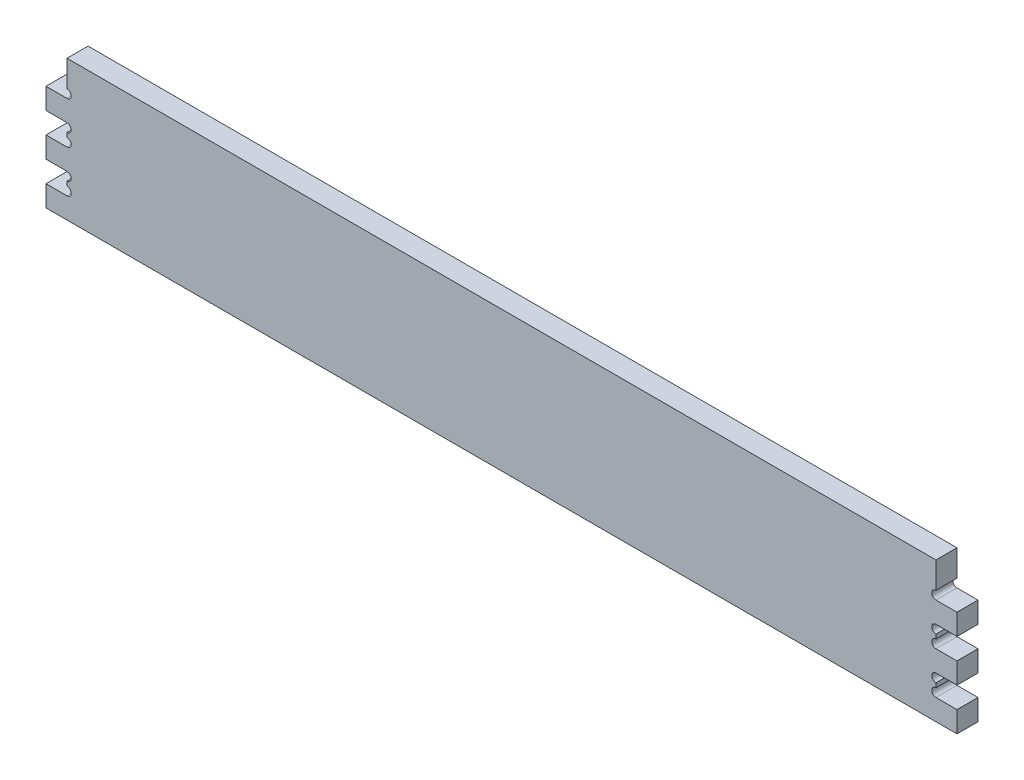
ISO-10303-21;
HEADER;
FILE_DESCRIPTION(('STEP AP214'),'2;1');
FILE_NAME('part.step','',(''),(''),'','','');
FILE_SCHEMA(('AUTOMOTIVE_DESIGN { 1 0 10303 214 1 1 1 1 }'));
ENDSEC;
DATA;
#1=APPLICATION_CONTEXT('core data for automotive mechanical design processes');
#2=APPLICATION_PROTOCOL_DEFINITION('international standard','automotive_design',2000,#1);
#3=PRODUCT_CONTEXT('',#1,'mechanical');
#4=PRODUCT('Part','Part','',(#3));
#5=PRODUCT_RELATED_PRODUCT_CATEGORY('part','',(#4));
#6=PRODUCT_DEFINITION_FORMATION('','',#4);
#7=PRODUCT_DEFINITION_CONTEXT('part definition',#1,'design');
#8=PRODUCT_DEFINITION('design','',#6,#7);
#9=PRODUCT_DEFINITION_SHAPE('','',#8);
#10=(LENGTH_UNIT() NAMED_UNIT(*) SI_UNIT(.MILLI.,.METRE.));
#11=(NAMED_UNIT(*) PLANE_ANGLE_UNIT() SI_UNIT($,.RADIAN.));
#12=(NAMED_UNIT(*) SI_UNIT($,.STERADIAN.) SOLID_ANGLE_UNIT());
#13=UNCERTAINTY_MEASURE_WITH_UNIT(LENGTH_MEASURE(1.E-05),#10,'distance_accuracy_value','');
#14=(GEOMETRIC_REPRESENTATION_CONTEXT(3) GLOBAL_UNCERTAINTY_ASSIGNED_CONTEXT((#13)) GLOBAL_UNIT_ASSIGNED_CONTEXT((#10,
#11,#12)) REPRESENTATION_CONTEXT('',''));
#15=CARTESIAN_POINT('',(0.,0.,0.));
#16=DIRECTION('',(0.,0.,1.));
#17=DIRECTION('',(1.,0.,0.));
#18=AXIS2_PLACEMENT_3D('',#15,#16,#17);
#19=CARTESIAN_POINT('',(620.,0.,15.));
#20=DIRECTION('',(0.,1.,0.));
#21=DIRECTION('',(-1.,0.,0.));
#22=AXIS2_PLACEMENT_3D('',#19,#20,#21);
#23=PLANE('',#22);
#24=DIRECTION('',(1.,0.,0.));
#25=VECTOR('',#24,1.);
#26=CARTESIAN_POINT('',(620.,0.,0.));
#27=LINE('',#26,#25);
#28=CARTESIAN_POINT('',(-15.,0.,0.));
#29=VERTEX_POINT('',#28);
#30=CARTESIAN_POINT('',(635.,0.,0.));
#31=VERTEX_POINT('',#30);
#32=EDGE_CURVE('E163',#29,#31,#27,.T.);
#33=ORIENTED_EDGE('',*,*,#32,.T.);
#34=DIRECTION('',(0.,0.,-1.));
#35=VECTOR('',#34,1.);
#36=CARTESIAN_POINT('',(635.,0.,15.));
#37=LINE('',#36,#35);
#38=CARTESIAN_POINT('',(635.,0.,15.));
#39=VERTEX_POINT('',#38);
#40=EDGE_CURVE('E11',#39,#31,#37,.T.);
#41=ORIENTED_EDGE('',*,*,#40,.F.);
#42=DIRECTION('',(1.,0.,0.));
#43=VECTOR('',#42,1.);
#44=CARTESIAN_POINT('',(0.,0.,15.));
#45=LINE('',#44,#43);
#46=CARTESIAN_POINT('',(-15.,0.,15.));
#47=VERTEX_POINT('',#46);
#48=EDGE_CURVE('E169',#47,#39,#45,.T.);
#49=ORIENTED_EDGE('',*,*,#48,.F.);
#50=DIRECTION('',(0.,0.,-1.));
#51=VECTOR('',#50,1.);
#52=CARTESIAN_POINT('',(-15.,0.,15.));
#53=LINE('',#52,#51);
#54=EDGE_CURVE('E281',#47,#29,#53,.T.);
#55=ORIENTED_EDGE('',*,*,#54,.T.);
#56=EDGE_LOOP('',(#33,#41,#49,#55));
#57=FACE_BOUND('',#56,.T.);
#58=ADVANCED_FACE('F33',(#57),#23,.F.);
#59=CARTESIAN_POINT('',(635.,0.,15.));
#60=DIRECTION('',(-1.,0.,0.));
#61=DIRECTION('',(0.,0.,1.));
#62=AXIS2_PLACEMENT_3D('',#59,#60,#61);
#63=PLANE('',#62);
#64=DIRECTION('',(0.,1.,0.));
#65=VECTOR('',#64,1.);
#66=CARTESIAN_POINT('',(635.,0.,0.));
#67=LINE('',#66,#65);
#68=CARTESIAN_POINT('',(635.,15.0000000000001,0.));
#69=VERTEX_POINT('',#68);
#70=EDGE_CURVE('E286',#31,#69,#67,.T.);
#71=ORIENTED_EDGE('',*,*,#70,.T.);
#72=DIRECTION('',(0.,0.,-1.));
#73=VECTOR('',#72,1.);
#74=CARTESIAN_POINT('',(635.,15.0000000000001,15.));
#75=LINE('',#74,#73);
#76=CARTESIAN_POINT('',(635.,15.0000000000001,15.));
#77=VERTEX_POINT('',#76);
#78=EDGE_CURVE('E41',#77,#69,#75,.T.);
#79=ORIENTED_EDGE('',*,*,#78,.F.);
#80=DIRECTION('',(0.,1.,0.));
#81=VECTOR('',#80,1.);
#82=CARTESIAN_POINT('',(635.,0.,15.));
#83=LINE('',#82,#81);
#84=EDGE_CURVE('E528',#39,#77,#83,.T.);
#85=ORIENTED_EDGE('',*,*,#84,.F.);
#86=ORIENTED_EDGE('',*,*,#40,.T.);
#87=EDGE_LOOP('',(#71,#79,#85,#86));
#88=FACE_BOUND('',#87,.T.);
#89=ADVANCED_FACE('F531',(#88),#63,.F.);
#90=CARTESIAN_POINT('',(635.,15.0000000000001,15.));
#91=DIRECTION('',(0.,-1.,0.));
#92=DIRECTION('',(1.,0.,0.));
#93=AXIS2_PLACEMENT_3D('',#90,#91,#92);
#94=PLANE('',#93);
#95=DIRECTION('',(-1.,0.,0.));
#96=VECTOR('',#95,1.);
#97=CARTESIAN_POINT('',(635.,15.0000000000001,0.));
#98=LINE('',#97,#96);
#99=CARTESIAN_POINT('',(620.,15.0000000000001,0.));
#100=VERTEX_POINT('',#99);
#101=EDGE_CURVE('E288',#69,#100,#98,.T.);
#102=ORIENTED_EDGE('',*,*,#101,.T.);
#103=DIRECTION('',(0.,0.,-1.));
#104=VECTOR('',#103,1.);
#105=CARTESIAN_POINT('',(620.,15.0000000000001,15.));
#106=LINE('',#105,#104);
#107=CARTESIAN_POINT('',(620.,15.0000000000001,15.));
#108=VERTEX_POINT('',#107);
#109=EDGE_CURVE('E435',#108,#100,#106,.T.);
#110=ORIENTED_EDGE('',*,*,#109,.F.);
#111=DIRECTION('',(-1.,0.,0.));
#112=VECTOR('',#111,1.);
#113=CARTESIAN_POINT('',(635.,15.0000000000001,15.));
#114=LINE('',#113,#112);
#115=EDGE_CURVE('E444',#77,#108,#114,.T.);
#116=ORIENTED_EDGE('',*,*,#115,.F.);
#117=ORIENTED_EDGE('',*,*,#78,.T.);
#118=EDGE_LOOP('',(#102,#110,#116,#117));
#119=FACE_BOUND('',#118,.T.);
#120=ADVANCED_FACE('F442',(#119),#94,.F.);
#121=CARTESIAN_POINT('',(620.,18.0000000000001,15.));
#122=DIRECTION('',(0.,0.,-1.));
#123=DIRECTION('',(-1.,0.,0.));
#124=AXIS2_PLACEMENT_3D('',#121,#122,#123);
#125=CYLINDRICAL_SURFACE('',#124,3.);
#126=CARTESIAN_POINT('',(620.,18.0000000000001,0.));
#127=DIRECTION('',(0.,0.,-1.));
#128=DIRECTION('',(1.,0.,0.));
#129=AXIS2_PLACEMENT_3D('',#126,#127,#128);
#130=CIRCLE('',#129,3.);
#131=CARTESIAN_POINT('',(620.,21.0000000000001,0.));
#132=VERTEX_POINT('',#131);
#133=EDGE_CURVE('E290',#100,#132,#130,.T.);
#134=ORIENTED_EDGE('',*,*,#133,.T.);
#135=DIRECTION('',(0.,0.,-1.));
#136=VECTOR('',#135,1.);
#137=CARTESIAN_POINT('',(620.,21.0000000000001,15.));
#138=LINE('',#137,#136);
#139=CARTESIAN_POINT('',(620.,21.0000000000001,15.));
#140=VERTEX_POINT('',#139);
#141=EDGE_CURVE('E432',#140,#132,#138,.T.);
#142=ORIENTED_EDGE('',*,*,#141,.F.);
#143=CARTESIAN_POINT('',(620.,18.0000000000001,15.));
#144=DIRECTION('',(0.,0.,-1.));
#145=DIRECTION('',(1.,0.,0.));
#146=AXIS2_PLACEMENT_3D('',#143,#144,#145);
#147=CIRCLE('',#146,3.);
#148=EDGE_CURVE('E462',#108,#140,#147,.T.);
#149=ORIENTED_EDGE('',*,*,#148,.F.);
#150=ORIENTED_EDGE('',*,*,#109,.T.);
#151=EDGE_LOOP('',(#134,#142,#149,#150));
#152=FACE_BOUND('',#151,.T.);
#153=ADVANCED_FACE('F453',(#152),#125,.F.);
#154=CARTESIAN_POINT('',(620.,24.1,15.));
#155=DIRECTION('',(-1.,0.,0.));
#156=DIRECTION('',(0.,0.,1.));
#157=AXIS2_PLACEMENT_3D('',#154,#155,#156);
#158=PLANE('',#157);
#159=DIRECTION('',(0.,1.,0.));
#160=VECTOR('',#159,1.);
#161=CARTESIAN_POINT('',(620.,24.1,0.));
#162=LINE('',#161,#160);
#163=CARTESIAN_POINT('',(620.,24.1,0.));
#164=VERTEX_POINT('',#163);
#165=EDGE_CURVE('E292',#132,#164,#162,.T.);
#166=ORIENTED_EDGE('',*,*,#165,.T.);
#167=DIRECTION('',(0.,0.,-1.));
#168=VECTOR('',#167,1.);
#169=CARTESIAN_POINT('',(620.,24.1,15.));
#170=LINE('',#169,#168);
#171=CARTESIAN_POINT('',(620.,24.1,15.));
#172=VERTEX_POINT('',#171);
#173=EDGE_CURVE('E429',#172,#164,#170,.T.);
#174=ORIENTED_EDGE('',*,*,#173,.F.);
#175=DIRECTION('',(0.,1.,0.));
#176=VECTOR('',#175,1.);
#177=CARTESIAN_POINT('',(620.,24.1,15.));
#178=LINE('',#177,#176);
#179=EDGE_CURVE('E459',#140,#172,#178,.T.);
#180=ORIENTED_EDGE('',*,*,#179,.F.);
#181=ORIENTED_EDGE('',*,*,#141,.T.);
#182=EDGE_LOOP('',(#166,#174,#180,#181));
#183=FACE_BOUND('',#182,.T.);
#184=ADVANCED_FACE('F457',(#183),#158,.F.);
#185=CARTESIAN_POINT('',(620.,27.1,15.));
#186=DIRECTION('',(0.,0.,-1.));
#187=DIRECTION('',(-1.,0.,0.));
#188=AXIS2_PLACEMENT_3D('',#185,#186,#187);
#189=CYLINDRICAL_SURFACE('',#188,3.);
#190=CARTESIAN_POINT('',(620.,27.1,0.));
#191=DIRECTION('',(0.,0.,-1.));
#192=DIRECTION('',(1.,0.,0.));
#193=AXIS2_PLACEMENT_3D('',#190,#191,#192);
#194=CIRCLE('',#193,3.);
#195=CARTESIAN_POINT('',(620.,30.1,0.));
#196=VERTEX_POINT('',#195);
#197=EDGE_CURVE('E294',#164,#196,#194,.T.);
#198=ORIENTED_EDGE('',*,*,#197,.T.);
#199=DIRECTION('',(0.,0.,-1.));
#200=VECTOR('',#199,1.);
#201=CARTESIAN_POINT('',(620.,30.1,15.));
#202=LINE('',#201,#200);
#203=CARTESIAN_POINT('',(620.,30.1,15.));
#204=VERTEX_POINT('',#203);
#205=EDGE_CURVE('E426',#204,#196,#202,.T.);
#206=ORIENTED_EDGE('',*,*,#205,.F.);
#207=CARTESIAN_POINT('',(620.,27.1,15.));
#208=DIRECTION('',(0.,0.,-1.));
#209=DIRECTION('',(1.,0.,0.));
#210=AXIS2_PLACEMENT_3D('',#207,#208,#209);
#211=CIRCLE('',#210,3.);
#212=EDGE_CURVE('E461',#172,#204,#211,.T.);
#213=ORIENTED_EDGE('',*,*,#212,.F.);
#214=ORIENTED_EDGE('',*,*,#173,.T.);
#215=EDGE_LOOP('',(#198,#206,#213,#214));
#216=FACE_BOUND('',#215,.T.);
#217=ADVANCED_FACE('F543',(#216),#189,.F.);
#218=CARTESIAN_POINT('',(620.,30.1,15.));
#219=DIRECTION('',(0.,1.,0.));
#220=DIRECTION('',(-1.,0.,0.));
#221=AXIS2_PLACEMENT_3D('',#218,#219,#220);
#222=PLANE('',#221);
#223=DIRECTION('',(1.,0.,0.));
#224=VECTOR('',#223,1.);
#225=CARTESIAN_POINT('',(620.,30.1,0.));
#226=LINE('',#225,#224);
#227=CARTESIAN_POINT('',(635.,30.1,0.));
#228=VERTEX_POINT('',#227);
#229=EDGE_CURVE('E296',#196,#228,#226,.T.);
#230=ORIENTED_EDGE('',*,*,#229,.T.);
#231=DIRECTION('',(0.,0.,-1.));
#232=VECTOR('',#231,1.);
#233=CARTESIAN_POINT('',(635.,30.1,15.));
#234=LINE('',#233,#232);
#235=CARTESIAN_POINT('',(635.,30.1,15.));
#236=VERTEX_POINT('',#235);
#237=EDGE_CURVE('E423',#236,#228,#234,.T.);
#238=ORIENTED_EDGE('',*,*,#237,.F.);
#239=DIRECTION('',(1.,0.,0.));
#240=VECTOR('',#239,1.);
#241=CARTESIAN_POINT('',(620.,30.1,15.));
#242=LINE('',#241,#240);
#243=EDGE_CURVE('E464',#204,#236,#242,.T.);
#244=ORIENTED_EDGE('',*,*,#243,.F.);
#245=ORIENTED_EDGE('',*,*,#205,.T.);
#246=EDGE_LOOP('',(#230,#238,#244,#245));
#247=FACE_BOUND('',#246,.T.);
#248=ADVANCED_FACE('F546',(#247),#222,.F.);
#249=CARTESIAN_POINT('',(635.,30.1,15.));
#250=DIRECTION('',(-1.,0.,0.));
#251=DIRECTION('',(0.,0.,1.));
#252=AXIS2_PLACEMENT_3D('',#249,#250,#251);
#253=PLANE('',#252);
#254=DIRECTION('',(0.,1.,0.));
#255=VECTOR('',#254,1.);
#256=CARTESIAN_POINT('',(635.,30.1,0.));
#257=LINE('',#256,#255);
#258=CARTESIAN_POINT('',(635.,45.1,0.));
#259=VERTEX_POINT('',#258);
#260=EDGE_CURVE('E298',#228,#259,#257,.T.);
#261=ORIENTED_EDGE('',*,*,#260,.T.);
#262=DIRECTION('',(0.,0.,-1.));
#263=VECTOR('',#262,1.);
#264=CARTESIAN_POINT('',(635.,45.1,15.));
#265=LINE('',#264,#263);
#266=CARTESIAN_POINT('',(635.,45.1,15.));
#267=VERTEX_POINT('',#266);
#268=EDGE_CURVE('E420',#267,#259,#265,.T.);
#269=ORIENTED_EDGE('',*,*,#268,.F.);
#270=DIRECTION('',(0.,1.,0.));
#271=VECTOR('',#270,1.);
#272=CARTESIAN_POINT('',(635.,30.1,15.));
#273=LINE('',#272,#271);
#274=EDGE_CURVE('E470',#236,#267,#273,.T.);
#275=ORIENTED_EDGE('',*,*,#274,.F.);
#276=ORIENTED_EDGE('',*,*,#237,.T.);
#277=EDGE_LOOP('',(#261,#269,#275,#276));
#278=FACE_BOUND('',#277,.T.);
#279=ADVANCED_FACE('F550',(#278),#253,.F.);
#280=CARTESIAN_POINT('',(635.,45.1,15.));
#281=DIRECTION('',(0.,-1.,0.));
#282=DIRECTION('',(0.,0.,-1.));
#283=AXIS2_PLACEMENT_3D('',#280,#281,#282);
#284=PLANE('',#283);
#285=DIRECTION('',(-1.,0.,0.));
#286=VECTOR('',#285,1.);
#287=CARTESIAN_POINT('',(635.,45.1,0.));
#288=LINE('',#287,#286);
#289=CARTESIAN_POINT('',(620.,45.1,0.));
#290=VERTEX_POINT('',#289);
#291=EDGE_CURVE('E300',#259,#290,#288,.T.);
#292=ORIENTED_EDGE('',*,*,#291,.T.);
#293=DIRECTION('',(0.,0.,-1.));
#294=VECTOR('',#293,1.);
#295=CARTESIAN_POINT('',(620.,45.1,15.));
#296=LINE('',#295,#294);
#297=CARTESIAN_POINT('',(620.,45.1,15.));
#298=VERTEX_POINT('',#297);
#299=EDGE_CURVE('E417',#298,#290,#296,.T.);
#300=ORIENTED_EDGE('',*,*,#299,.F.);
#301=DIRECTION('',(-1.,0.,0.));
#302=VECTOR('',#301,1.);
#303=CARTESIAN_POINT('',(635.,45.1,15.));
#304=LINE('',#303,#302);
#305=EDGE_CURVE('E472',#267,#298,#304,.T.);
#306=ORIENTED_EDGE('',*,*,#305,.F.);
#307=ORIENTED_EDGE('',*,*,#268,.T.);
#308=EDGE_LOOP('',(#292,#300,#306,#307));
#309=FACE_BOUND('',#308,.T.);
#310=ADVANCED_FACE('F554',(#309),#284,.F.);
#311=CARTESIAN_POINT('',(620.,48.1,15.));
#312=DIRECTION('',(0.,0.,-1.));
#313=DIRECTION('',(-1.,0.,0.));
#314=AXIS2_PLACEMENT_3D('',#311,#312,#313);
#315=CYLINDRICAL_SURFACE('',#314,3.);
#316=CARTESIAN_POINT('',(620.,48.1,0.));
#317=DIRECTION('',(0.,0.,-1.));
#318=DIRECTION('',(1.,0.,0.));
#319=AXIS2_PLACEMENT_3D('',#316,#317,#318);
#320=CIRCLE('',#319,3.);
#321=CARTESIAN_POINT('',(620.,51.1,0.));
#322=VERTEX_POINT('',#321);
#323=EDGE_CURVE('E302',#290,#322,#320,.T.);
#324=ORIENTED_EDGE('',*,*,#323,.T.);
#325=DIRECTION('',(0.,0.,-1.));
#326=VECTOR('',#325,1.);
#327=CARTESIAN_POINT('',(620.,51.1,15.));
#328=LINE('',#327,#326);
#329=CARTESIAN_POINT('',(620.,51.1,15.));
#330=VERTEX_POINT('',#329);
#331=EDGE_CURVE('E414',#330,#322,#328,.T.);
#332=ORIENTED_EDGE('',*,*,#331,.F.);
#333=CARTESIAN_POINT('',(620.,48.1,15.));
#334=DIRECTION('',(0.,0.,-1.));
#335=DIRECTION('',(1.,0.,0.));
#336=AXIS2_PLACEMENT_3D('',#333,#334,#335);
#337=CIRCLE('',#336,3.);
#338=EDGE_CURVE('E474',#298,#330,#337,.T.);
#339=ORIENTED_EDGE('',*,*,#338,.F.);
#340=ORIENTED_EDGE('',*,*,#299,.T.);
#341=EDGE_LOOP('',(#324,#332,#339,#340));
#342=FACE_BOUND('',#341,.T.);
#343=ADVANCED_FACE('F558',(#342),#315,.F.);
#344=CARTESIAN_POINT('',(620.,54.2,15.));
#345=DIRECTION('',(-1.,0.,0.));
#346=DIRECTION('',(0.,0.,1.));
#347=AXIS2_PLACEMENT_3D('',#344,#345,#346);
#348=PLANE('',#347);
#349=DIRECTION('',(0.,1.,0.));
#350=VECTOR('',#349,1.);
#351=CARTESIAN_POINT('',(620.,54.2,0.));
#352=LINE('',#351,#350);
#353=CARTESIAN_POINT('',(620.,54.2,0.));
#354=VERTEX_POINT('',#353);
#355=EDGE_CURVE('E304',#322,#354,#352,.T.);
#356=ORIENTED_EDGE('',*,*,#355,.T.);
#357=DIRECTION('',(0.,0.,-1.));
#358=VECTOR('',#357,1.);
#359=CARTESIAN_POINT('',(620.,54.2,15.));
#360=LINE('',#359,#358);
#361=CARTESIAN_POINT('',(620.,54.2,15.));
#362=VERTEX_POINT('',#361);
#363=EDGE_CURVE('E411',#362,#354,#360,.T.);
#364=ORIENTED_EDGE('',*,*,#363,.F.);
#365=DIRECTION('',(0.,1.,0.));
#366=VECTOR('',#365,1.);
#367=CARTESIAN_POINT('',(620.,54.2,15.));
#368=LINE('',#367,#366);
#369=EDGE_CURVE('E476',#330,#362,#368,.T.);
#370=ORIENTED_EDGE('',*,*,#369,.F.);
#371=ORIENTED_EDGE('',*,*,#331,.T.);
#372=EDGE_LOOP('',(#356,#364,#370,#371));
#373=FACE_BOUND('',#372,.T.);
#374=ADVANCED_FACE('F562',(#373),#348,.F.);
#375=CARTESIAN_POINT('',(620.,57.2,15.));
#376=DIRECTION('',(0.,0.,-1.));
#377=DIRECTION('',(-1.,0.,0.));
#378=AXIS2_PLACEMENT_3D('',#375,#376,#377);
#379=CYLINDRICAL_SURFACE('',#378,3.);
#380=CARTESIAN_POINT('',(620.,57.2,0.));
#381=DIRECTION('',(0.,0.,-1.));
#382=DIRECTION('',(1.,0.,0.));
#383=AXIS2_PLACEMENT_3D('',#380,#381,#382);
#384=CIRCLE('',#383,3.);
#385=CARTESIAN_POINT('',(620.,60.2,0.));
#386=VERTEX_POINT('',#385);
#387=EDGE_CURVE('E306',#354,#386,#384,.T.);
#388=ORIENTED_EDGE('',*,*,#387,.T.);
#389=DIRECTION('',(0.,0.,-1.));
#390=VECTOR('',#389,1.);
#391=CARTESIAN_POINT('',(620.,60.2,15.));
#392=LINE('',#391,#390);
#393=CARTESIAN_POINT('',(620.,60.2,15.));
#394=VERTEX_POINT('',#393);
#395=EDGE_CURVE('E408',#394,#386,#392,.T.);
#396=ORIENTED_EDGE('',*,*,#395,.F.);
#397=CARTESIAN_POINT('',(620.,57.2,15.));
#398=DIRECTION('',(0.,0.,-1.));
#399=DIRECTION('',(1.,0.,0.));
#400=AXIS2_PLACEMENT_3D('',#397,#398,#399);
#401=CIRCLE('',#400,3.);
#402=EDGE_CURVE('E478',#362,#394,#401,.T.);
#403=ORIENTED_EDGE('',*,*,#402,.F.);
#404=ORIENTED_EDGE('',*,*,#363,.T.);
#405=EDGE_LOOP('',(#388,#396,#403,#404));
#406=FACE_BOUND('',#405,.T.);
#407=ADVANCED_FACE('F566',(#406),#379,.F.);
#408=CARTESIAN_POINT('',(620.,60.2,15.));
#409=DIRECTION('',(0.,1.,0.));
#410=DIRECTION('',(-1.,0.,0.));
#411=AXIS2_PLACEMENT_3D('',#408,#409,#410);
#412=PLANE('',#411);
#413=DIRECTION('',(1.,0.,0.));
#414=VECTOR('',#413,1.);
#415=CARTESIAN_POINT('',(620.,60.2,0.));
#416=LINE('',#415,#414);
#417=CARTESIAN_POINT('',(635.,60.2,0.));
#418=VERTEX_POINT('',#417);
#419=EDGE_CURVE('E308',#386,#418,#416,.T.);
#420=ORIENTED_EDGE('',*,*,#419,.T.);
#421=DIRECTION('',(0.,0.,-1.));
#422=VECTOR('',#421,1.);
#423=CARTESIAN_POINT('',(635.,60.2,15.));
#424=LINE('',#423,#422);
#425=CARTESIAN_POINT('',(635.,60.2,15.));
#426=VERTEX_POINT('',#425);
#427=EDGE_CURVE('E405',#426,#418,#424,.T.);
#428=ORIENTED_EDGE('',*,*,#427,.F.);
#429=DIRECTION('',(1.,0.,0.));
#430=VECTOR('',#429,1.);
#431=CARTESIAN_POINT('',(620.,60.2,15.));
#432=LINE('',#431,#430);
#433=EDGE_CURVE('E480',#394,#426,#432,.T.);
#434=ORIENTED_EDGE('',*,*,#433,.F.);
#435=ORIENTED_EDGE('',*,*,#395,.T.);
#436=EDGE_LOOP('',(#420,#428,#434,#435));
#437=FACE_BOUND('',#436,.T.);
#438=ADVANCED_FACE('F570',(#437),#412,.F.);
#439=CARTESIAN_POINT('',(635.,60.2,15.));
#440=DIRECTION('',(-1.,0.,0.));
#441=DIRECTION('',(0.,0.,1.));
#442=AXIS2_PLACEMENT_3D('',#439,#440,#441);
#443=PLANE('',#442);
#444=DIRECTION('',(0.,1.,0.));
#445=VECTOR('',#444,1.);
#446=CARTESIAN_POINT('',(635.,60.2,0.));
#447=LINE('',#446,#445);
#448=CARTESIAN_POINT('',(635.,75.2,0.));
#449=VERTEX_POINT('',#448);
#450=EDGE_CURVE('E310',#418,#449,#447,.T.);
#451=ORIENTED_EDGE('',*,*,#450,.T.);
#452=DIRECTION('',(0.,0.,-1.));
#453=VECTOR('',#452,1.);
#454=CARTESIAN_POINT('',(635.,75.2,15.));
#455=LINE('',#454,#453);
#456=CARTESIAN_POINT('',(635.,75.2,15.));
#457=VERTEX_POINT('',#456);
#458=EDGE_CURVE('E402',#457,#449,#455,.T.);
#459=ORIENTED_EDGE('',*,*,#458,.F.);
#460=DIRECTION('',(0.,1.,0.));
#461=VECTOR('',#460,1.);
#462=CARTESIAN_POINT('',(635.,60.2,15.));
#463=LINE('',#462,#461);
#464=EDGE_CURVE('E482',#426,#457,#463,.T.);
#465=ORIENTED_EDGE('',*,*,#464,.F.);
#466=ORIENTED_EDGE('',*,*,#427,.T.);
#467=EDGE_LOOP('',(#451,#459,#465,#466));
#468=FACE_BOUND('',#467,.T.);
#469=ADVANCED_FACE('F574',(#468),#443,.F.);
#470=CARTESIAN_POINT('',(635.,75.2,15.));
#471=DIRECTION('',(0.,-1.,0.));
#472=DIRECTION('',(0.,0.,-1.));
#473=AXIS2_PLACEMENT_3D('',#470,#471,#472);
#474=PLANE('',#473);
#475=DIRECTION('',(-1.,0.,0.));
#476=VECTOR('',#475,1.);
#477=CARTESIAN_POINT('',(635.,75.2,0.));
#478=LINE('',#477,#476);
#479=CARTESIAN_POINT('',(620.,75.2,0.));
#480=VERTEX_POINT('',#479);
#481=EDGE_CURVE('E312',#449,#480,#478,.T.);
#482=ORIENTED_EDGE('',*,*,#481,.T.);
#483=DIRECTION('',(0.,0.,-1.));
#484=VECTOR('',#483,1.);
#485=CARTESIAN_POINT('',(620.,75.2,15.));
#486=LINE('',#485,#484);
#487=CARTESIAN_POINT('',(620.,75.2,15.));
#488=VERTEX_POINT('',#487);
#489=EDGE_CURVE('E399',#488,#480,#486,.T.);
#490=ORIENTED_EDGE('',*,*,#489,.F.);
#491=DIRECTION('',(-1.,0.,0.));
#492=VECTOR('',#491,1.);
#493=CARTESIAN_POINT('',(635.,75.2,15.));
#494=LINE('',#493,#492);
#495=EDGE_CURVE('E484',#457,#488,#494,.T.);
#496=ORIENTED_EDGE('',*,*,#495,.F.);
#497=ORIENTED_EDGE('',*,*,#458,.T.);
#498=EDGE_LOOP('',(#482,#490,#496,#497));
#499=FACE_BOUND('',#498,.T.);
#500=ADVANCED_FACE('F578',(#499),#474,.F.);
#501=CARTESIAN_POINT('',(620.,78.2,15.));
#502=DIRECTION('',(0.,0.,-1.));
#503=DIRECTION('',(-1.,0.,0.));
#504=AXIS2_PLACEMENT_3D('',#501,#502,#503);
#505=CYLINDRICAL_SURFACE('',#504,3.);
#506=CARTESIAN_POINT('',(620.,78.2,0.));
#507=DIRECTION('',(0.,0.,-1.));
#508=DIRECTION('',(1.,0.,0.));
#509=AXIS2_PLACEMENT_3D('',#506,#507,#508);
#510=CIRCLE('',#509,3.);
#511=CARTESIAN_POINT('',(620.,81.2,0.));
#512=VERTEX_POINT('',#511);
#513=EDGE_CURVE('E314',#480,#512,#510,.T.);
#514=ORIENTED_EDGE('',*,*,#513,.T.);
#515=DIRECTION('',(0.,0.,-1.));
#516=VECTOR('',#515,1.);
#517=CARTESIAN_POINT('',(620.,81.2,15.));
#518=LINE('',#517,#516);
#519=CARTESIAN_POINT('',(620.,81.2,15.));
#520=VERTEX_POINT('',#519);
#521=EDGE_CURVE('E396',#520,#512,#518,.T.);
#522=ORIENTED_EDGE('',*,*,#521,.F.);
#523=CARTESIAN_POINT('',(620.,78.2,15.));
#524=DIRECTION('',(0.,0.,-1.));
#525=DIRECTION('',(1.,0.,0.));
#526=AXIS2_PLACEMENT_3D('',#523,#524,#525);
#527=CIRCLE('',#526,3.);
#528=EDGE_CURVE('E486',#488,#520,#527,.T.);
#529=ORIENTED_EDGE('',*,*,#528,.F.);
#530=ORIENTED_EDGE('',*,*,#489,.T.);
#531=EDGE_LOOP('',(#514,#522,#529,#530));
#532=FACE_BOUND('',#531,.T.);
#533=ADVANCED_FACE('F582',(#532),#505,.F.);
#534=CARTESIAN_POINT('',(620.,100.,15.));
#535=DIRECTION('',(-1.,0.,0.));
#536=DIRECTION('',(0.,0.,1.));
#537=AXIS2_PLACEMENT_3D('',#534,#535,#536);
#538=PLANE('',#537);
#539=DIRECTION('',(0.,1.,0.));
#540=VECTOR('',#539,1.);
#541=CARTESIAN_POINT('',(620.,100.,0.));
#542=LINE('',#541,#540);
#543=CARTESIAN_POINT('',(620.,100.,0.));
#544=VERTEX_POINT('',#543);
#545=EDGE_CURVE('E316',#512,#544,#542,.T.);
#546=ORIENTED_EDGE('',*,*,#545,.T.);
#547=DIRECTION('',(0.,0.,-1.));
#548=VECTOR('',#547,1.);
#549=CARTESIAN_POINT('',(620.,100.,15.));
#550=LINE('',#549,#548);
#551=CARTESIAN_POINT('',(620.,100.,15.));
#552=VERTEX_POINT('',#551);
#553=EDGE_CURVE('E393',#552,#544,#550,.T.);
#554=ORIENTED_EDGE('',*,*,#553,.F.);
#555=DIRECTION('',(0.,1.,0.));
#556=VECTOR('',#555,1.);
#557=CARTESIAN_POINT('',(620.,100.,15.));
#558=LINE('',#557,#556);
#559=EDGE_CURVE('E488',#520,#552,#558,.T.);
#560=ORIENTED_EDGE('',*,*,#559,.F.);
#561=ORIENTED_EDGE('',*,*,#521,.T.);
#562=EDGE_LOOP('',(#546,#554,#560,#561));
#563=FACE_BOUND('',#562,.T.);
#564=ADVANCED_FACE('F586',(#563),#538,.F.);
#565=CARTESIAN_POINT('',(0.,100.,15.));
#566=DIRECTION('',(0.,-1.,0.));
#567=DIRECTION('',(1.,0.,0.));
#568=AXIS2_PLACEMENT_3D('',#565,#566,#567);
#569=PLANE('',#568);
#570=DIRECTION('',(-1.,0.,0.));
#571=VECTOR('',#570,1.);
#572=CARTESIAN_POINT('',(0.,100.,0.));
#573=LINE('',#572,#571);
#574=CARTESIAN_POINT('',(0.,100.,0.));
#575=VERTEX_POINT('',#574);
#576=EDGE_CURVE('E318',#544,#575,#573,.T.);
#577=ORIENTED_EDGE('',*,*,#576,.T.);
#578=DIRECTION('',(0.,0.,-1.));
#579=VECTOR('',#578,1.);
#580=CARTESIAN_POINT('',(0.,100.,15.));
#581=LINE('',#580,#579);
#582=CARTESIAN_POINT('',(0.,100.,15.));
#583=VERTEX_POINT('',#582);
#584=EDGE_CURVE('E390',#583,#575,#581,.T.);
#585=ORIENTED_EDGE('',*,*,#584,.F.);
#586=DIRECTION('',(-1.,0.,0.));
#587=VECTOR('',#586,1.);
#588=CARTESIAN_POINT('',(0.,100.,15.));
#589=LINE('',#588,#587);
#590=EDGE_CURVE('E490',#552,#583,#589,.T.);
#591=ORIENTED_EDGE('',*,*,#590,.F.);
#592=ORIENTED_EDGE('',*,*,#553,.T.);
#593=EDGE_LOOP('',(#577,#585,#591,#592));
#594=FACE_BOUND('',#593,.T.);
#595=ADVANCED_FACE('F590',(#594),#569,.F.);
#596=CARTESIAN_POINT('',(0.,100.,15.));
#597=DIRECTION('',(1.,0.,0.));
#598=DIRECTION('',(0.,1.,0.));
#599=AXIS2_PLACEMENT_3D('',#596,#597,#598);
#600=PLANE('',#599);
#601=DIRECTION('',(0.,-1.,0.));
#602=VECTOR('',#601,1.);
#603=CARTESIAN_POINT('',(0.,100.,0.));
#604=LINE('',#603,#602);
#605=CARTESIAN_POINT('',(0.,81.2,0.));
#606=VERTEX_POINT('',#605);
#607=EDGE_CURVE('E320',#575,#606,#604,.T.);
#608=ORIENTED_EDGE('',*,*,#607,.T.);
#609=DIRECTION('',(0.,0.,-1.));
#610=VECTOR('',#609,1.);
#611=CARTESIAN_POINT('',(0.,81.2,15.));
#612=LINE('',#611,#610);
#613=CARTESIAN_POINT('',(0.,81.2,15.));
#614=VERTEX_POINT('',#613);
#615=EDGE_CURVE('E387',#614,#606,#612,.T.);
#616=ORIENTED_EDGE('',*,*,#615,.F.);
#617=DIRECTION('',(0.,-1.,0.));
#618=VECTOR('',#617,1.);
#619=CARTESIAN_POINT('',(0.,100.,15.));
#620=LINE('',#619,#618);
#621=EDGE_CURVE('E492',#583,#614,#620,.T.);
#622=ORIENTED_EDGE('',*,*,#621,.F.);
#623=ORIENTED_EDGE('',*,*,#584,.T.);
#624=EDGE_LOOP('',(#608,#616,#622,#623));
#625=FACE_BOUND('',#624,.T.);
#626=ADVANCED_FACE('F594',(#625),#600,.F.);
#627=CARTESIAN_POINT('',(0.,78.2,15.));
#628=DIRECTION('',(0.,0.,-1.));
#629=DIRECTION('',(-1.,0.,0.));
#630=AXIS2_PLACEMENT_3D('',#627,#628,#629);
#631=CYLINDRICAL_SURFACE('',#630,3.);
#632=CARTESIAN_POINT('',(0.,78.2,0.));
#633=DIRECTION('',(0.,0.,-1.));
#634=DIRECTION('',(1.,0.,0.));
#635=AXIS2_PLACEMENT_3D('',#632,#633,#634);
#636=CIRCLE('',#635,3.);
#637=CARTESIAN_POINT('',(0.,75.2,0.));
#638=VERTEX_POINT('',#637);
#639=EDGE_CURVE('E322',#606,#638,#636,.T.);
#640=ORIENTED_EDGE('',*,*,#639,.T.);
#641=DIRECTION('',(0.,0.,-1.));
#642=VECTOR('',#641,1.);
#643=CARTESIAN_POINT('',(0.,75.2,15.));
#644=LINE('',#643,#642);
#645=CARTESIAN_POINT('',(0.,75.2,15.));
#646=VERTEX_POINT('',#645);
#647=EDGE_CURVE('E384',#646,#638,#644,.T.);
#648=ORIENTED_EDGE('',*,*,#647,.F.);
#649=CARTESIAN_POINT('',(0.,78.2,15.));
#650=DIRECTION('',(0.,0.,-1.));
#651=DIRECTION('',(1.,0.,0.));
#652=AXIS2_PLACEMENT_3D('',#649,#650,#651);
#653=CIRCLE('',#652,3.);
#654=EDGE_CURVE('E494',#614,#646,#653,.T.);
#655=ORIENTED_EDGE('',*,*,#654,.F.);
#656=ORIENTED_EDGE('',*,*,#615,.T.);
#657=EDGE_LOOP('',(#640,#648,#655,#656));
#658=FACE_BOUND('',#657,.T.);
#659=ADVANCED_FACE('F598',(#658),#631,.F.);
#660=CARTESIAN_POINT('',(-15.,75.2,15.));
#661=DIRECTION('',(0.,-1.,0.));
#662=DIRECTION('',(0.,0.,-1.));
#663=AXIS2_PLACEMENT_3D('',#660,#661,#662);
#664=PLANE('',#663);
#665=DIRECTION('',(-1.,0.,0.));
#666=VECTOR('',#665,1.);
#667=CARTESIAN_POINT('',(-15.,75.2,0.));
#668=LINE('',#667,#666);
#669=CARTESIAN_POINT('',(-15.,75.2,0.));
#670=VERTEX_POINT('',#669);
#671=EDGE_CURVE('E324',#638,#670,#668,.T.);
#672=ORIENTED_EDGE('',*,*,#671,.T.);
#673=DIRECTION('',(0.,0.,-1.));
#674=VECTOR('',#673,1.);
#675=CARTESIAN_POINT('',(-15.,75.2,15.));
#676=LINE('',#675,#674);
#677=CARTESIAN_POINT('',(-15.,75.2,15.));
#678=VERTEX_POINT('',#677);
#679=EDGE_CURVE('E381',#678,#670,#676,.T.);
#680=ORIENTED_EDGE('',*,*,#679,.F.);
#681=DIRECTION('',(-1.,0.,0.));
#682=VECTOR('',#681,1.);
#683=CARTESIAN_POINT('',(-15.,75.2,15.));
#684=LINE('',#683,#682);
#685=EDGE_CURVE('E496',#646,#678,#684,.T.);
#686=ORIENTED_EDGE('',*,*,#685,.F.);
#687=ORIENTED_EDGE('',*,*,#647,.T.);
#688=EDGE_LOOP('',(#672,#680,#686,#687));
#689=FACE_BOUND('',#688,.T.);
#690=ADVANCED_FACE('F602',(#689),#664,.F.);
#691=CARTESIAN_POINT('',(-15.,60.2,15.));
#692=DIRECTION('',(1.,0.,0.));
#693=DIRECTION('',(0.,0.,-1.));
#694=AXIS2_PLACEMENT_3D('',#691,#692,#693);
#695=PLANE('',#694);
#696=DIRECTION('',(0.,-1.,0.));
#697=VECTOR('',#696,1.);
#698=CARTESIAN_POINT('',(-15.,60.2,0.));
#699=LINE('',#698,#697);
#700=CARTESIAN_POINT('',(-15.,60.2,0.));
#701=VERTEX_POINT('',#700);
#702=EDGE_CURVE('E326',#670,#701,#699,.T.);
#703=ORIENTED_EDGE('',*,*,#702,.T.);
#704=DIRECTION('',(0.,0.,-1.));
#705=VECTOR('',#704,1.);
#706=CARTESIAN_POINT('',(-15.,60.2,15.));
#707=LINE('',#706,#705);
#708=CARTESIAN_POINT('',(-15.,60.2,15.));
#709=VERTEX_POINT('',#708);
#710=EDGE_CURVE('E378',#709,#701,#707,.T.);
#711=ORIENTED_EDGE('',*,*,#710,.F.);
#712=DIRECTION('',(0.,-1.,0.));
#713=VECTOR('',#712,1.);
#714=CARTESIAN_POINT('',(-15.,60.2,15.));
#715=LINE('',#714,#713);
#716=EDGE_CURVE('E498',#678,#709,#715,.T.);
#717=ORIENTED_EDGE('',*,*,#716,.F.);
#718=ORIENTED_EDGE('',*,*,#679,.T.);
#719=EDGE_LOOP('',(#703,#711,#717,#718));
#720=FACE_BOUND('',#719,.T.);
#721=ADVANCED_FACE('F606',(#720),#695,.F.);
#722=CARTESIAN_POINT('',(0.,60.2,15.));
#723=DIRECTION('',(0.,1.,0.));
#724=DIRECTION('',(0.,0.,1.));
#725=AXIS2_PLACEMENT_3D('',#722,#723,#724);
#726=PLANE('',#725);
#727=DIRECTION('',(1.,0.,0.));
#728=VECTOR('',#727,1.);
#729=CARTESIAN_POINT('',(0.,60.2,0.));
#730=LINE('',#729,#728);
#731=CARTESIAN_POINT('',(0.,60.2,0.));
#732=VERTEX_POINT('',#731);
#733=EDGE_CURVE('E328',#701,#732,#730,.T.);
#734=ORIENTED_EDGE('',*,*,#733,.T.);
#735=DIRECTION('',(0.,0.,-1.));
#736=VECTOR('',#735,1.);
#737=CARTESIAN_POINT('',(0.,60.2,15.));
#738=LINE('',#737,#736);
#739=CARTESIAN_POINT('',(0.,60.2,15.));
#740=VERTEX_POINT('',#739);
#741=EDGE_CURVE('E375',#740,#732,#738,.T.);
#742=ORIENTED_EDGE('',*,*,#741,.F.);
#743=DIRECTION('',(1.,0.,0.));
#744=VECTOR('',#743,1.);
#745=CARTESIAN_POINT('',(0.,60.2,15.));
#746=LINE('',#745,#744);
#747=EDGE_CURVE('E500',#709,#740,#746,.T.);
#748=ORIENTED_EDGE('',*,*,#747,.F.);
#749=ORIENTED_EDGE('',*,*,#710,.T.);
#750=EDGE_LOOP('',(#734,#742,#748,#749));
#751=FACE_BOUND('',#750,.T.);
#752=ADVANCED_FACE('F610',(#751),#726,.F.);
#753=CARTESIAN_POINT('',(0.,57.2,15.));
#754=DIRECTION('',(0.,0.,-1.));
#755=DIRECTION('',(-1.,0.,0.));
#756=AXIS2_PLACEMENT_3D('',#753,#754,#755);
#757=CYLINDRICAL_SURFACE('',#756,3.);
#758=CARTESIAN_POINT('',(0.,57.2,0.));
#759=DIRECTION('',(0.,0.,-1.));
#760=DIRECTION('',(1.,0.,0.));
#761=AXIS2_PLACEMENT_3D('',#758,#759,#760);
#762=CIRCLE('',#761,3.);
#763=CARTESIAN_POINT('',(0.,54.2,0.));
#764=VERTEX_POINT('',#763);
#765=EDGE_CURVE('E330',#732,#764,#762,.T.);
#766=ORIENTED_EDGE('',*,*,#765,.T.);
#767=DIRECTION('',(0.,0.,-1.));
#768=VECTOR('',#767,1.);
#769=CARTESIAN_POINT('',(0.,54.2,15.));
#770=LINE('',#769,#768);
#771=CARTESIAN_POINT('',(0.,54.2,15.));
#772=VERTEX_POINT('',#771);
#773=EDGE_CURVE('E372',#772,#764,#770,.T.);
#774=ORIENTED_EDGE('',*,*,#773,.F.);
#775=CARTESIAN_POINT('',(0.,57.2,15.));
#776=DIRECTION('',(0.,0.,-1.));
#777=DIRECTION('',(1.,0.,0.));
#778=AXIS2_PLACEMENT_3D('',#775,#776,#777);
#779=CIRCLE('',#778,3.);
#780=EDGE_CURVE('E502',#740,#772,#779,.T.);
#781=ORIENTED_EDGE('',*,*,#780,.F.);
#782=ORIENTED_EDGE('',*,*,#741,.T.);
#783=EDGE_LOOP('',(#766,#774,#781,#782));
#784=FACE_BOUND('',#783,.T.);
#785=ADVANCED_FACE('F614',(#784),#757,.F.);
#786=CARTESIAN_POINT('',(0.,54.2,15.));
#787=DIRECTION('',(1.,0.,0.));
#788=DIRECTION('',(0.,1.,0.));
#789=AXIS2_PLACEMENT_3D('',#786,#787,#788);
#790=PLANE('',#789);
#791=DIRECTION('',(0.,-1.,0.));
#792=VECTOR('',#791,1.);
#793=CARTESIAN_POINT('',(0.,54.2,0.));
#794=LINE('',#793,#792);
#795=CARTESIAN_POINT('',(0.,51.1,0.));
#796=VERTEX_POINT('',#795);
#797=EDGE_CURVE('E332',#764,#796,#794,.T.);
#798=ORIENTED_EDGE('',*,*,#797,.T.);
#799=DIRECTION('',(0.,0.,-1.));
#800=VECTOR('',#799,1.);
#801=CARTESIAN_POINT('',(0.,51.1,15.));
#802=LINE('',#801,#800);
#803=CARTESIAN_POINT('',(0.,51.1,15.));
#804=VERTEX_POINT('',#803);
#805=EDGE_CURVE('E369',#804,#796,#802,.T.);
#806=ORIENTED_EDGE('',*,*,#805,.F.);
#807=DIRECTION('',(0.,-1.,0.));
#808=VECTOR('',#807,1.);
#809=CARTESIAN_POINT('',(0.,54.2,15.));
#810=LINE('',#809,#808);
#811=EDGE_CURVE('E504',#772,#804,#810,.T.);
#812=ORIENTED_EDGE('',*,*,#811,.F.);
#813=ORIENTED_EDGE('',*,*,#773,.T.);
#814=EDGE_LOOP('',(#798,#806,#812,#813));
#815=FACE_BOUND('',#814,.T.);
#816=ADVANCED_FACE('F618',(#815),#790,.F.);
#817=CARTESIAN_POINT('',(0.,48.1,15.));
#818=DIRECTION('',(0.,0.,-1.));
#819=DIRECTION('',(-1.,0.,0.));
#820=AXIS2_PLACEMENT_3D('',#817,#818,#819);
#821=CYLINDRICAL_SURFACE('',#820,3.);
#822=CARTESIAN_POINT('',(0.,48.1,0.));
#823=DIRECTION('',(0.,0.,-1.));
#824=DIRECTION('',(1.,0.,0.));
#825=AXIS2_PLACEMENT_3D('',#822,#823,#824);
#826=CIRCLE('',#825,3.);
#827=CARTESIAN_POINT('',(0.,45.1,0.));
#828=VERTEX_POINT('',#827);
#829=EDGE_CURVE('E334',#796,#828,#826,.T.);
#830=ORIENTED_EDGE('',*,*,#829,.T.);
#831=DIRECTION('',(0.,0.,-1.));
#832=VECTOR('',#831,1.);
#833=CARTESIAN_POINT('',(0.,45.1,15.));
#834=LINE('',#833,#832);
#835=CARTESIAN_POINT('',(0.,45.1,15.));
#836=VERTEX_POINT('',#835);
#837=EDGE_CURVE('E366',#836,#828,#834,.T.);
#838=ORIENTED_EDGE('',*,*,#837,.F.);
#839=CARTESIAN_POINT('',(0.,48.1,15.));
#840=DIRECTION('',(0.,0.,-1.));
#841=DIRECTION('',(1.,0.,0.));
#842=AXIS2_PLACEMENT_3D('',#839,#840,#841);
#843=CIRCLE('',#842,3.);
#844=EDGE_CURVE('E506',#804,#836,#843,.T.);
#845=ORIENTED_EDGE('',*,*,#844,.F.);
#846=ORIENTED_EDGE('',*,*,#805,.T.);
#847=EDGE_LOOP('',(#830,#838,#845,#846));
#848=FACE_BOUND('',#847,.T.);
#849=ADVANCED_FACE('F622',(#848),#821,.F.);
#850=CARTESIAN_POINT('',(-15.,45.1,15.));
#851=DIRECTION('',(0.,-1.,0.));
#852=DIRECTION('',(1.,0.,0.));
#853=AXIS2_PLACEMENT_3D('',#850,#851,#852);
#854=PLANE('',#853);
#855=DIRECTION('',(-1.,0.,0.));
#856=VECTOR('',#855,1.);
#857=CARTESIAN_POINT('',(-15.,45.1,0.));
#858=LINE('',#857,#856);
#859=CARTESIAN_POINT('',(-15.,45.1,0.));
#860=VERTEX_POINT('',#859);
#861=EDGE_CURVE('E336',#828,#860,#858,.T.);
#862=ORIENTED_EDGE('',*,*,#861,.T.);
#863=DIRECTION('',(0.,0.,-1.));
#864=VECTOR('',#863,1.);
#865=CARTESIAN_POINT('',(-15.,45.1,15.));
#866=LINE('',#865,#864);
#867=CARTESIAN_POINT('',(-15.,45.1,15.));
#868=VERTEX_POINT('',#867);
#869=EDGE_CURVE('E363',#868,#860,#866,.T.);
#870=ORIENTED_EDGE('',*,*,#869,.F.);
#871=DIRECTION('',(-1.,0.,0.));
#872=VECTOR('',#871,1.);
#873=CARTESIAN_POINT('',(-15.,45.1,15.));
#874=LINE('',#873,#872);
#875=EDGE_CURVE('E508',#836,#868,#874,.T.);
#876=ORIENTED_EDGE('',*,*,#875,.F.);
#877=ORIENTED_EDGE('',*,*,#837,.T.);
#878=EDGE_LOOP('',(#862,#870,#876,#877));
#879=FACE_BOUND('',#878,.T.);
#880=ADVANCED_FACE('F626',(#879),#854,.F.);
#881=CARTESIAN_POINT('',(-15.,30.1,15.));
#882=DIRECTION('',(1.,0.,0.));
#883=DIRECTION('',(0.,0.,-1.));
#884=AXIS2_PLACEMENT_3D('',#881,#882,#883);
#885=PLANE('',#884);
#886=DIRECTION('',(0.,-1.,0.));
#887=VECTOR('',#886,1.);
#888=CARTESIAN_POINT('',(-15.,30.1,0.));
#889=LINE('',#888,#887);
#890=CARTESIAN_POINT('',(-15.,30.1,0.));
#891=VERTEX_POINT('',#890);
#892=EDGE_CURVE('E338',#860,#891,#889,.T.);
#893=ORIENTED_EDGE('',*,*,#892,.T.);
#894=DIRECTION('',(0.,0.,-1.));
#895=VECTOR('',#894,1.);
#896=CARTESIAN_POINT('',(-15.,30.1,15.));
#897=LINE('',#896,#895);
#898=CARTESIAN_POINT('',(-15.,30.1,15.));
#899=VERTEX_POINT('',#898);
#900=EDGE_CURVE('E360',#899,#891,#897,.T.);
#901=ORIENTED_EDGE('',*,*,#900,.F.);
#902=DIRECTION('',(0.,-1.,0.));
#903=VECTOR('',#902,1.);
#904=CARTESIAN_POINT('',(-15.,30.1,15.));
#905=LINE('',#904,#903);
#906=EDGE_CURVE('E510',#868,#899,#905,.T.);
#907=ORIENTED_EDGE('',*,*,#906,.F.);
#908=ORIENTED_EDGE('',*,*,#869,.T.);
#909=EDGE_LOOP('',(#893,#901,#907,#908));
#910=FACE_BOUND('',#909,.T.);
#911=ADVANCED_FACE('F630',(#910),#885,.F.);
#912=CARTESIAN_POINT('',(0.,30.1,15.));
#913=DIRECTION('',(0.,1.,0.));
#914=DIRECTION('',(-1.,0.,0.));
#915=AXIS2_PLACEMENT_3D('',#912,#913,#914);
#916=PLANE('',#915);
#917=DIRECTION('',(1.,0.,0.));
#918=VECTOR('',#917,1.);
#919=CARTESIAN_POINT('',(0.,30.1,0.));
#920=LINE('',#919,#918);
#921=CARTESIAN_POINT('',(0.,30.1,0.));
#922=VERTEX_POINT('',#921);
#923=EDGE_CURVE('E340',#891,#922,#920,.T.);
#924=ORIENTED_EDGE('',*,*,#923,.T.);
#925=DIRECTION('',(0.,0.,-1.));
#926=VECTOR('',#925,1.);
#927=CARTESIAN_POINT('',(0.,30.1,15.));
#928=LINE('',#927,#926);
#929=CARTESIAN_POINT('',(0.,30.1,15.));
#930=VERTEX_POINT('',#929);
#931=EDGE_CURVE('E357',#930,#922,#928,.T.);
#932=ORIENTED_EDGE('',*,*,#931,.F.);
#933=DIRECTION('',(1.,0.,0.));
#934=VECTOR('',#933,1.);
#935=CARTESIAN_POINT('',(0.,30.1,15.));
#936=LINE('',#935,#934);
#937=EDGE_CURVE('E512',#899,#930,#936,.T.);
#938=ORIENTED_EDGE('',*,*,#937,.F.);
#939=ORIENTED_EDGE('',*,*,#900,.T.);
#940=EDGE_LOOP('',(#924,#932,#938,#939));
#941=FACE_BOUND('',#940,.T.);
#942=ADVANCED_FACE('F634',(#941),#916,.F.);
#943=CARTESIAN_POINT('',(0.,27.1,15.));
#944=DIRECTION('',(0.,0.,-1.));
#945=DIRECTION('',(-1.,0.,0.));
#946=AXIS2_PLACEMENT_3D('',#943,#944,#945);
#947=CYLINDRICAL_SURFACE('',#946,3.);
#948=CARTESIAN_POINT('',(0.,27.1,0.));
#949=DIRECTION('',(0.,0.,-1.));
#950=DIRECTION('',(1.,0.,0.));
#951=AXIS2_PLACEMENT_3D('',#948,#949,#950);
#952=CIRCLE('',#951,3.);
#953=CARTESIAN_POINT('',(0.,24.1,0.));
#954=VERTEX_POINT('',#953);
#955=EDGE_CURVE('E342',#922,#954,#952,.T.);
#956=ORIENTED_EDGE('',*,*,#955,.T.);
#957=DIRECTION('',(0.,0.,-1.));
#958=VECTOR('',#957,1.);
#959=CARTESIAN_POINT('',(0.,24.1,15.));
#960=LINE('',#959,#958);
#961=CARTESIAN_POINT('',(0.,24.1,15.));
#962=VERTEX_POINT('',#961);
#963=EDGE_CURVE('E354',#962,#954,#960,.T.);
#964=ORIENTED_EDGE('',*,*,#963,.F.);
#965=CARTESIAN_POINT('',(0.,27.1,15.));
#966=DIRECTION('',(0.,0.,-1.));
#967=DIRECTION('',(1.,0.,0.));
#968=AXIS2_PLACEMENT_3D('',#965,#966,#967);
#969=CIRCLE('',#968,3.);
#970=EDGE_CURVE('E514',#930,#962,#969,.T.);
#971=ORIENTED_EDGE('',*,*,#970,.F.);
#972=ORIENTED_EDGE('',*,*,#931,.T.);
#973=EDGE_LOOP('',(#956,#964,#971,#972));
#974=FACE_BOUND('',#973,.T.);
#975=ADVANCED_FACE('F520',(#974),#947,.F.);
#976=CARTESIAN_POINT('',(0.,24.1,15.));
#977=DIRECTION('',(1.,0.,0.));
#978=DIRECTION('',(0.,1.,0.));
#979=AXIS2_PLACEMENT_3D('',#976,#977,#978);
#980=PLANE('',#979);
#981=DIRECTION('',(0.,-1.,0.));
#982=VECTOR('',#981,1.);
#983=CARTESIAN_POINT('',(0.,24.1,0.));
#984=LINE('',#983,#982);
#985=CARTESIAN_POINT('',(0.,21.,0.));
#986=VERTEX_POINT('',#985);
#987=EDGE_CURVE('E344',#954,#986,#984,.T.);
#988=ORIENTED_EDGE('',*,*,#987,.T.);
#989=DIRECTION('',(0.,0.,-1.));
#990=VECTOR('',#989,1.);
#991=CARTESIAN_POINT('',(0.,21.,15.));
#992=LINE('',#991,#990);
#993=CARTESIAN_POINT('',(0.,21.,15.));
#994=VERTEX_POINT('',#993);
#995=EDGE_CURVE('E276',#994,#986,#992,.T.);
#996=ORIENTED_EDGE('',*,*,#995,.F.);
#997=DIRECTION('',(0.,-1.,0.));
#998=VECTOR('',#997,1.);
#999=CARTESIAN_POINT('',(0.,24.1,15.));
#1000=LINE('',#999,#998);
#1001=EDGE_CURVE('E267',#962,#994,#1000,.T.);
#1002=ORIENTED_EDGE('',*,*,#1001,.F.);
#1003=ORIENTED_EDGE('',*,*,#963,.T.);
#1004=EDGE_LOOP('',(#988,#996,#1002,#1003));
#1005=FACE_BOUND('',#1004,.T.);
#1006=ADVANCED_FACE('F524',(#1005),#980,.F.);
#1007=CARTESIAN_POINT('',(0.,18.,15.));
#1008=DIRECTION('',(0.,0.,-1.));
#1009=DIRECTION('',(-1.,0.,0.));
#1010=AXIS2_PLACEMENT_3D('',#1007,#1008,#1009);
#1011=CYLINDRICAL_SURFACE('',#1010,3.);
#1012=CARTESIAN_POINT('',(0.,18.,0.));
#1013=DIRECTION('',(0.,0.,-1.));
#1014=DIRECTION('',(1.,0.,0.));
#1015=AXIS2_PLACEMENT_3D('',#1012,#1013,#1014);
#1016=CIRCLE('',#1015,3.);
#1017=CARTESIAN_POINT('',(0.,15.,0.));
#1018=VERTEX_POINT('',#1017);
#1019=EDGE_CURVE('E275',#986,#1018,#1016,.T.);
#1020=ORIENTED_EDGE('',*,*,#1019,.T.);
#1021=DIRECTION('',(0.,0.,-1.));
#1022=VECTOR('',#1021,1.);
#1023=CARTESIAN_POINT('',(0.,15.,15.));
#1024=LINE('',#1023,#1022);
#1025=CARTESIAN_POINT('',(0.,15.,15.));
#1026=VERTEX_POINT('',#1025);
#1027=EDGE_CURVE('E272',#1026,#1018,#1024,.T.);
#1028=ORIENTED_EDGE('',*,*,#1027,.F.);
#1029=CARTESIAN_POINT('',(0.,18.,15.));
#1030=DIRECTION('',(0.,0.,-1.));
#1031=DIRECTION('',(1.,0.,0.));
#1032=AXIS2_PLACEMENT_3D('',#1029,#1030,#1031);
#1033=CIRCLE('',#1032,3.);
#1034=EDGE_CURVE('E261',#994,#1026,#1033,.T.);
#1035=ORIENTED_EDGE('',*,*,#1034,.F.);
#1036=ORIENTED_EDGE('',*,*,#995,.T.);
#1037=EDGE_LOOP('',(#1020,#1028,#1035,#1036));
#1038=FACE_BOUND('',#1037,.T.);
#1039=ADVANCED_FACE('F273',(#1038),#1011,.F.);
#1040=CARTESIAN_POINT('',(-15.,15.,15.));
#1041=DIRECTION('',(0.,-1.,0.));
#1042=DIRECTION('',(0.,0.,-1.));
#1043=AXIS2_PLACEMENT_3D('',#1040,#1041,#1042);
#1044=PLANE('',#1043);
#1045=DIRECTION('',(-1.,0.,0.));
#1046=VECTOR('',#1045,1.);
#1047=CARTESIAN_POINT('',(-15.,15.,0.));
#1048=LINE('',#1047,#1046);
#1049=CARTESIAN_POINT('',(-15.,15.,0.));
#1050=VERTEX_POINT('',#1049);
#1051=EDGE_CURVE('E156',#1018,#1050,#1048,.T.);
#1052=ORIENTED_EDGE('',*,*,#1051,.T.);
#1053=DIRECTION('',(0.,0.,-1.));
#1054=VECTOR('',#1053,1.);
#1055=CARTESIAN_POINT('',(-15.,15.,15.));
#1056=LINE('',#1055,#1054);
#1057=CARTESIAN_POINT('',(-15.,15.,15.));
#1058=VERTEX_POINT('',#1057);
#1059=EDGE_CURVE('E277',#1058,#1050,#1056,.T.);
#1060=ORIENTED_EDGE('',*,*,#1059,.F.);
#1061=DIRECTION('',(-1.,0.,0.));
#1062=VECTOR('',#1061,1.);
#1063=CARTESIAN_POINT('',(-15.,15.,15.));
#1064=LINE('',#1063,#1062);
#1065=EDGE_CURVE('E265',#1026,#1058,#1064,.T.);
#1066=ORIENTED_EDGE('',*,*,#1065,.F.);
#1067=ORIENTED_EDGE('',*,*,#1027,.T.);
#1068=EDGE_LOOP('',(#1052,#1060,#1066,#1067));
#1069=FACE_BOUND('',#1068,.T.);
#1070=ADVANCED_FACE('F279',(#1069),#1044,.F.);
#1071=CARTESIAN_POINT('',(-15.,0.,15.));
#1072=DIRECTION('',(1.,0.,0.));
#1073=DIRECTION('',(0.,0.,-1.));
#1074=AXIS2_PLACEMENT_3D('',#1071,#1072,#1073);
#1075=PLANE('',#1074);
#1076=DIRECTION('',(0.,-1.,0.));
#1077=VECTOR('',#1076,1.);
#1078=CARTESIAN_POINT('',(-15.,0.,0.));
#1079=LINE('',#1078,#1077);
#1080=EDGE_CURVE('E348',#1050,#29,#1079,.T.);
#1081=ORIENTED_EDGE('',*,*,#1080,.T.);
#1082=ORIENTED_EDGE('',*,*,#54,.F.);
#1083=DIRECTION('',(0.,-1.,0.));
#1084=VECTOR('',#1083,1.);
#1085=CARTESIAN_POINT('',(-15.,0.,15.));
#1086=LINE('',#1085,#1084);
#1087=EDGE_CURVE('E49',#1058,#47,#1086,.T.);
#1088=ORIENTED_EDGE('',*,*,#1087,.F.);
#1089=ORIENTED_EDGE('',*,*,#1059,.T.);
#1090=EDGE_LOOP('',(#1081,#1082,#1088,#1089));
#1091=FACE_BOUND('',#1090,.T.);
#1092=ADVANCED_FACE('F526',(#1091),#1075,.F.);
#1093=CARTESIAN_POINT('',(0.,18.,15.));
#1094=DIRECTION('',(0.,0.,1.));
#1095=DIRECTION('',(1.,0.,0.));
#1096=AXIS2_PLACEMENT_3D('',#1093,#1094,#1095);
#1097=PLANE('',#1096);
#1098=ORIENTED_EDGE('',*,*,#48,.T.);
#1099=ORIENTED_EDGE('',*,*,#84,.T.);
#1100=ORIENTED_EDGE('',*,*,#115,.T.);
#1101=ORIENTED_EDGE('',*,*,#148,.T.);
#1102=ORIENTED_EDGE('',*,*,#179,.T.);
#1103=ORIENTED_EDGE('',*,*,#212,.T.);
#1104=ORIENTED_EDGE('',*,*,#243,.T.);
#1105=ORIENTED_EDGE('',*,*,#274,.T.);
#1106=ORIENTED_EDGE('',*,*,#305,.T.);
#1107=ORIENTED_EDGE('',*,*,#338,.T.);
#1108=ORIENTED_EDGE('',*,*,#369,.T.);
#1109=ORIENTED_EDGE('',*,*,#402,.T.);
#1110=ORIENTED_EDGE('',*,*,#433,.T.);
#1111=ORIENTED_EDGE('',*,*,#464,.T.);
#1112=ORIENTED_EDGE('',*,*,#495,.T.);
#1113=ORIENTED_EDGE('',*,*,#528,.T.);
#1114=ORIENTED_EDGE('',*,*,#559,.T.);
#1115=ORIENTED_EDGE('',*,*,#590,.T.);
#1116=ORIENTED_EDGE('',*,*,#621,.T.);
#1117=ORIENTED_EDGE('',*,*,#654,.T.);
#1118=ORIENTED_EDGE('',*,*,#685,.T.);
#1119=ORIENTED_EDGE('',*,*,#716,.T.);
#1120=ORIENTED_EDGE('',*,*,#747,.T.);
#1121=ORIENTED_EDGE('',*,*,#780,.T.);
#1122=ORIENTED_EDGE('',*,*,#811,.T.);
#1123=ORIENTED_EDGE('',*,*,#844,.T.);
#1124=ORIENTED_EDGE('',*,*,#875,.T.);
#1125=ORIENTED_EDGE('',*,*,#906,.T.);
#1126=ORIENTED_EDGE('',*,*,#937,.T.);
#1127=ORIENTED_EDGE('',*,*,#970,.T.);
#1128=ORIENTED_EDGE('',*,*,#1001,.T.);
#1129=ORIENTED_EDGE('',*,*,#1034,.T.);
#1130=ORIENTED_EDGE('',*,*,#1065,.T.);
#1131=ORIENTED_EDGE('',*,*,#1087,.T.);
#1132=EDGE_LOOP('',(#1098,#1099,#1100,#1101,#1102,#1103,#1104,#1105,#1106,#1107,#1108,#1109,
#1110,#1111,#1112,#1113,#1114,#1115,#1116,#1117,#1118,#1119,#1120,#1121,#1122,#1123,#1124,#1125,
#1126,#1127,#1128,#1129,#1130,#1131));
#1133=FACE_BOUND('',#1132,.T.);
#1134=ADVANCED_FACE('F263',(#1133),#1097,.T.);
#1135=CARTESIAN_POINT('',(0.,18.,0.));
#1136=DIRECTION('',(0.,0.,1.));
#1137=DIRECTION('',(1.,0.,0.));
#1138=AXIS2_PLACEMENT_3D('',#1135,#1136,#1137);
#1139=PLANE('',#1138);
#1140=ORIENTED_EDGE('',*,*,#32,.F.);
#1141=ORIENTED_EDGE('',*,*,#1080,.F.);
#1142=ORIENTED_EDGE('',*,*,#1051,.F.);
#1143=ORIENTED_EDGE('',*,*,#1019,.F.);
#1144=ORIENTED_EDGE('',*,*,#987,.F.);
#1145=ORIENTED_EDGE('',*,*,#955,.F.);
#1146=ORIENTED_EDGE('',*,*,#923,.F.);
#1147=ORIENTED_EDGE('',*,*,#892,.F.);
#1148=ORIENTED_EDGE('',*,*,#861,.F.);
#1149=ORIENTED_EDGE('',*,*,#829,.F.);
#1150=ORIENTED_EDGE('',*,*,#797,.F.);
#1151=ORIENTED_EDGE('',*,*,#765,.F.);
#1152=ORIENTED_EDGE('',*,*,#733,.F.);
#1153=ORIENTED_EDGE('',*,*,#702,.F.);
#1154=ORIENTED_EDGE('',*,*,#671,.F.);
#1155=ORIENTED_EDGE('',*,*,#639,.F.);
#1156=ORIENTED_EDGE('',*,*,#607,.F.);
#1157=ORIENTED_EDGE('',*,*,#576,.F.);
#1158=ORIENTED_EDGE('',*,*,#545,.F.);
#1159=ORIENTED_EDGE('',*,*,#513,.F.);
#1160=ORIENTED_EDGE('',*,*,#481,.F.);
#1161=ORIENTED_EDGE('',*,*,#450,.F.);
#1162=ORIENTED_EDGE('',*,*,#419,.F.);
#1163=ORIENTED_EDGE('',*,*,#387,.F.);
#1164=ORIENTED_EDGE('',*,*,#355,.F.);
#1165=ORIENTED_EDGE('',*,*,#323,.F.);
#1166=ORIENTED_EDGE('',*,*,#291,.F.);
#1167=ORIENTED_EDGE('',*,*,#260,.F.);
#1168=ORIENTED_EDGE('',*,*,#229,.F.);
#1169=ORIENTED_EDGE('',*,*,#197,.F.);
#1170=ORIENTED_EDGE('',*,*,#165,.F.);
#1171=ORIENTED_EDGE('',*,*,#133,.F.);
#1172=ORIENTED_EDGE('',*,*,#101,.F.);
#1173=ORIENTED_EDGE('',*,*,#70,.F.);
#1174=EDGE_LOOP('',(#1140,#1141,#1142,#1143,#1144,#1145,#1146,#1147,#1148,#1149,#1150,#1151,
#1152,#1153,#1154,#1155,#1156,#1157,#1158,#1159,#1160,#1161,#1162,#1163,#1164,#1165,#1166,#1167,
#1168,#1169,#1170,#1171,#1172,#1173));
#1175=FACE_BOUND('',#1174,.T.);
#1176=ADVANCED_FACE('F448',(#1175),#1139,.F.);
#1177=CLOSED_SHELL('',(#58,#89,#120,#153,#184,#217,#248,#279,#310,#343,#374,#407,#438,#469,#500,
#533,#564,#595,#626,#659,#690,#721,#752,#785,#816,#849,#880,#911,#942,#975,#1006,#1039,#1070,
#1092,#1134,#1176));
#1178=MANIFOLD_SOLID_BREP('B2',#1177);
#1179=ADVANCED_BREP_SHAPE_REPRESENTATION('',(#18,#1178),#14);
#1180=SHAPE_DEFINITION_REPRESENTATION(#9,#1179);
ENDSEC;
END-ISO-10303-21;
